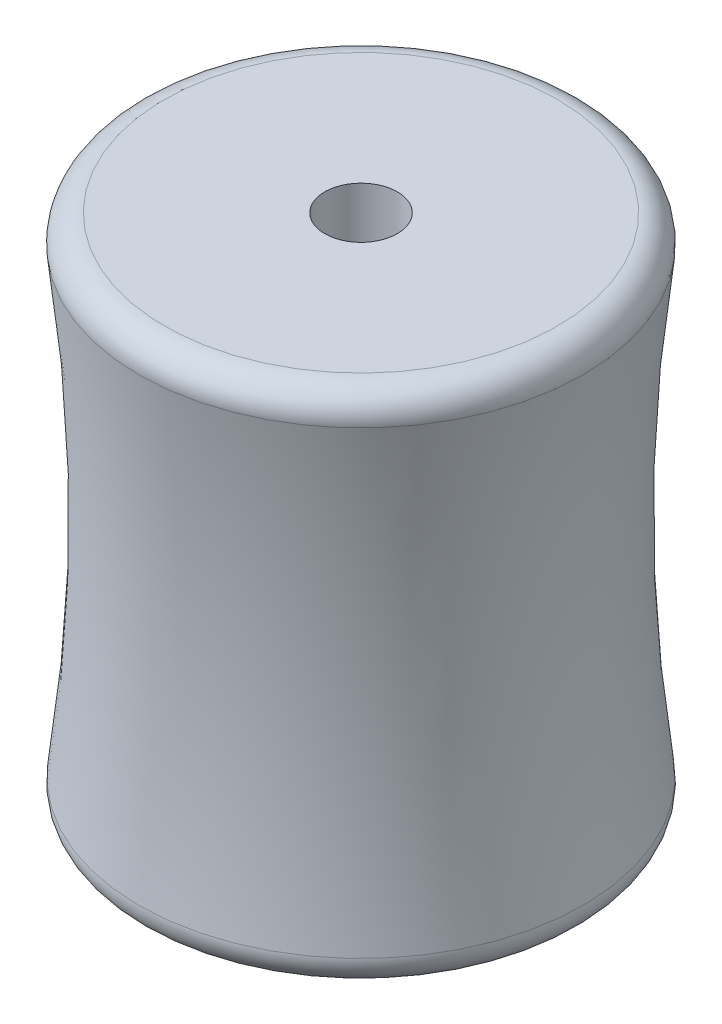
ISO-10303-21;
HEADER;
FILE_DESCRIPTION(('STEP AP214'),'2;1');
FILE_NAME('part.step','',(''),(''),'','','');
FILE_SCHEMA(('AUTOMOTIVE_DESIGN { 1 0 10303 214 1 1 1 1 }'));
ENDSEC;
DATA;
#1=APPLICATION_CONTEXT('core data for automotive mechanical design processes');
#2=APPLICATION_PROTOCOL_DEFINITION('international standard','automotive_design',2000,#1);
#3=PRODUCT_CONTEXT('',#1,'mechanical');
#4=PRODUCT('Part','Part','',(#3));
#5=PRODUCT_RELATED_PRODUCT_CATEGORY('part','',(#4));
#6=PRODUCT_DEFINITION_FORMATION('','',#4);
#7=PRODUCT_DEFINITION_CONTEXT('part definition',#1,'design');
#8=PRODUCT_DEFINITION('design','',#6,#7);
#9=PRODUCT_DEFINITION_SHAPE('','',#8);
#10=(LENGTH_UNIT() NAMED_UNIT(*) SI_UNIT(.MILLI.,.METRE.));
#11=(NAMED_UNIT(*) PLANE_ANGLE_UNIT() SI_UNIT($,.RADIAN.));
#12=(NAMED_UNIT(*) SI_UNIT($,.STERADIAN.) SOLID_ANGLE_UNIT());
#13=UNCERTAINTY_MEASURE_WITH_UNIT(LENGTH_MEASURE(1.E-05),#10,'distance_accuracy_value','');
#14=(GEOMETRIC_REPRESENTATION_CONTEXT(3) GLOBAL_UNCERTAINTY_ASSIGNED_CONTEXT((#13)) GLOBAL_UNIT_ASSIGNED_CONTEXT((#10,
#11,#12)) REPRESENTATION_CONTEXT('',''));
#15=CARTESIAN_POINT('',(0.,0.,0.));
#16=DIRECTION('',(0.,0.,1.));
#17=DIRECTION('',(1.,0.,0.));
#18=AXIS2_PLACEMENT_3D('',#15,#16,#17);
#19=CARTESIAN_POINT('',(0.,30.,8.20000000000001));
#20=DIRECTION('',(0.,1.,0.));
#21=DIRECTION('',(0.,0.,1.));
#22=AXIS2_PLACEMENT_3D('',#19,#20,#21);
#23=TOROIDAL_SURFACE('',#22,223.937199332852,200.);
#24=CARTESIAN_POINT('',(0.,56.6009852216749,8.20000000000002));
#25=DIRECTION('',(0.,-1.,0.));
#26=DIRECTION('',(0.,0.,-1.));
#27=AXIS2_PLACEMENT_3D('',#24,#25,#26);
#28=CIRCLE('',#27,25.7141240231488);
#29=CARTESIAN_POINT('',(0.,56.6009852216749,-17.5141240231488));
#30=VERTEX_POINT('',#29);
#31=EDGE_CURVE('E50',#30,#30,#28,.T.);
#32=ORIENTED_EDGE('',*,*,#31,.T.);
#33=EDGE_LOOP('',(#32));
#34=FACE_BOUND('',#33,.T.);
#35=CARTESIAN_POINT('',(0.,3.39901477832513,8.20000000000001));
#36=DIRECTION('',(0.,1.,0.));
#37=DIRECTION('',(0.,0.,1.));
#38=AXIS2_PLACEMENT_3D('',#35,#36,#37);
#39=CIRCLE('',#38,25.7141240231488);
#40=CARTESIAN_POINT('',(0.,3.39901477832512,33.9141240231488));
#41=VERTEX_POINT('',#40);
#42=EDGE_CURVE('E55',#41,#41,#39,.T.);
#43=ORIENTED_EDGE('',*,*,#42,.T.);
#44=EDGE_LOOP('',(#43));
#45=FACE_BOUND('',#44,.T.);
#46=ADVANCED_FACE('F42',(#34,#45),#23,.F.);
#47=CARTESIAN_POINT('',(0.,0.,4.));
#48=DIRECTION('',(0.,1.,0.));
#49=DIRECTION('',(0.,0.,1.));
#50=AXIS2_PLACEMENT_3D('',#47,#48,#49);
#51=PLANE('',#50);
#52=CARTESIAN_POINT('',(0.,0.,8.20000000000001));
#53=DIRECTION('',(0.,1.,0.));
#54=DIRECTION('',(0.,0.,1.));
#55=AXIS2_PLACEMENT_3D('',#52,#53,#54);
#56=CIRCLE('',#55,22.7407778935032);
#57=CARTESIAN_POINT('',(0.,0.,30.9407778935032));
#58=VERTEX_POINT('',#57);
#59=EDGE_CURVE('E10',#58,#58,#56,.F.);
#60=ORIENTED_EDGE('',*,*,#59,.T.);
#61=EDGE_LOOP('',(#60));
#62=FACE_BOUND('',#61,.T.);
#63=CARTESIAN_POINT('',(0.,0.,8.2));
#64=DIRECTION('',(0.,1.,0.));
#65=DIRECTION('',(0.,0.,1.));
#66=AXIS2_PLACEMENT_3D('',#63,#64,#65);
#67=CIRCLE('',#66,4.2);
#68=CARTESIAN_POINT('',(0.,0.,12.4));
#69=VERTEX_POINT('',#68);
#70=EDGE_CURVE('E66',#69,#69,#67,.T.);
#71=ORIENTED_EDGE('',*,*,#70,.T.);
#72=EDGE_LOOP('',(#71));
#73=FACE_BOUND('',#72,.T.);
#74=ADVANCED_FACE('F88',(#62,#73),#51,.F.);
#75=CARTESIAN_POINT('',(0.,60.,8.20000000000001));
#76=DIRECTION('',(0.,1.,0.));
#77=DIRECTION('',(0.,0.,1.));
#78=AXIS2_PLACEMENT_3D('',#75,#76,#77);
#79=CYLINDRICAL_SURFACE('',#78,4.2);
#80=ORIENTED_EDGE('',*,*,#70,.F.);
#81=EDGE_LOOP('',(#80));
#82=FACE_BOUND('',#81,.T.);
#83=CARTESIAN_POINT('',(0.,60.,8.20000000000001));
#84=DIRECTION('',(0.,1.,0.));
#85=DIRECTION('',(0.,0.,1.));
#86=AXIS2_PLACEMENT_3D('',#83,#84,#85);
#87=CIRCLE('',#86,4.2);
#88=CARTESIAN_POINT('',(0.,60.,12.4));
#89=VERTEX_POINT('',#88);
#90=EDGE_CURVE('E70',#89,#89,#87,.T.);
#91=ORIENTED_EDGE('',*,*,#90,.T.);
#92=EDGE_LOOP('',(#91));
#93=FACE_BOUND('',#92,.T.);
#94=ADVANCED_FACE('F75',(#82,#93),#79,.F.);
#95=CARTESIAN_POINT('',(0.,60.,-18.));
#96=DIRECTION('',(0.,-1.,0.));
#97=DIRECTION('',(0.,0.,-1.));
#98=AXIS2_PLACEMENT_3D('',#95,#96,#97);
#99=PLANE('',#98);
#100=CARTESIAN_POINT('',(0.,60.,8.20000000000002));
#101=DIRECTION('',(0.,-1.,0.));
#102=DIRECTION('',(0.,0.,-1.));
#103=AXIS2_PLACEMENT_3D('',#100,#101,#102);
#104=CIRCLE('',#103,22.7407778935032);
#105=CARTESIAN_POINT('',(0.,60.,-14.5407778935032));
#106=VERTEX_POINT('',#105);
#107=EDGE_CURVE('E60',#106,#106,#104,.F.);
#108=ORIENTED_EDGE('',*,*,#107,.T.);
#109=EDGE_LOOP('',(#108));
#110=FACE_BOUND('',#109,.T.);
#111=ORIENTED_EDGE('',*,*,#90,.F.);
#112=EDGE_LOOP('',(#111));
#113=FACE_BOUND('',#112,.T.);
#114=ADVANCED_FACE('F77',(#110,#113),#99,.F.);
#115=CARTESIAN_POINT('',(0.,57.,8.20000000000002));
#116=DIRECTION('',(0.,1.,0.));
#117=DIRECTION('',(0.,0.,1.));
#118=AXIS2_PLACEMENT_3D('',#115,#116,#117);
#119=TOROIDAL_SURFACE('',#118,22.7407778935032,3.);
#120=ORIENTED_EDGE('',*,*,#31,.F.);
#121=EDGE_LOOP('',(#120));
#122=FACE_BOUND('',#121,.T.);
#123=ORIENTED_EDGE('',*,*,#107,.F.);
#124=EDGE_LOOP('',(#123));
#125=FACE_BOUND('',#124,.T.);
#126=ADVANCED_FACE('F79',(#122,#125),#119,.T.);
#127=CARTESIAN_POINT('',(0.,3.,8.20000000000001));
#128=DIRECTION('',(0.,-1.,0.));
#129=DIRECTION('',(0.,0.,-1.));
#130=AXIS2_PLACEMENT_3D('',#127,#128,#129);
#131=TOROIDAL_SURFACE('',#130,22.7407778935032,3.);
#132=ORIENTED_EDGE('',*,*,#59,.F.);
#133=EDGE_LOOP('',(#132));
#134=FACE_BOUND('',#133,.T.);
#135=ORIENTED_EDGE('',*,*,#42,.F.);
#136=EDGE_LOOP('',(#135));
#137=FACE_BOUND('',#136,.T.);
#138=ADVANCED_FACE('F44',(#134,#137),#131,.T.);
#139=CLOSED_SHELL('',(#46,#74,#94,#114,#126,#138));
#140=MANIFOLD_SOLID_BREP('B2',#139);
#141=ADVANCED_BREP_SHAPE_REPRESENTATION('',(#18,#140),#14);
#142=SHAPE_DEFINITION_REPRESENTATION(#9,#141);
ENDSEC;
END-ISO-10303-21;
